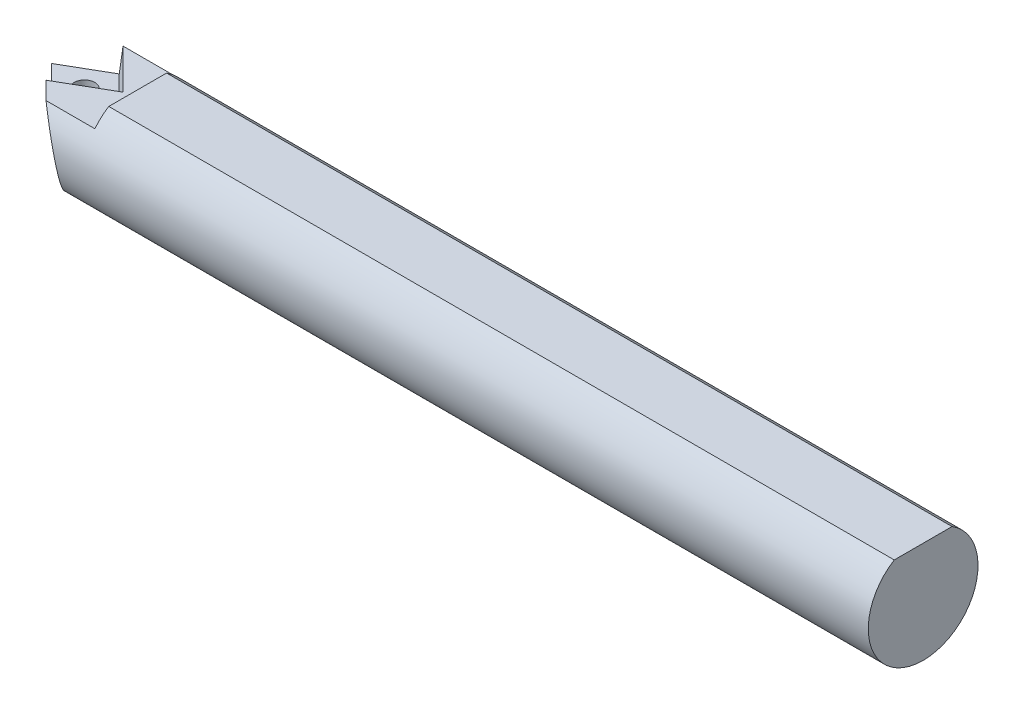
ISO-10303-21;
HEADER;
FILE_DESCRIPTION(('STEP AP214'),'2;1');
FILE_NAME('part.step','',(''),(''),'','','');
FILE_SCHEMA(('AUTOMOTIVE_DESIGN { 1 0 10303 214 1 1 1 1 }'));
ENDSEC;
DATA;
#1=APPLICATION_CONTEXT('core data for automotive mechanical design processes');
#2=APPLICATION_PROTOCOL_DEFINITION('international standard','automotive_design',2000,#1);
#3=PRODUCT_CONTEXT('',#1,'mechanical');
#4=PRODUCT('Part','Part','',(#3));
#5=PRODUCT_RELATED_PRODUCT_CATEGORY('part','',(#4));
#6=PRODUCT_DEFINITION_FORMATION('','',#4);
#7=PRODUCT_DEFINITION_CONTEXT('part definition',#1,'design');
#8=PRODUCT_DEFINITION('design','',#6,#7);
#9=PRODUCT_DEFINITION_SHAPE('','',#8);
#10=(LENGTH_UNIT() NAMED_UNIT(*) SI_UNIT(.MILLI.,.METRE.));
#11=(NAMED_UNIT(*) PLANE_ANGLE_UNIT() SI_UNIT($,.RADIAN.));
#12=(NAMED_UNIT(*) SI_UNIT($,.STERADIAN.) SOLID_ANGLE_UNIT());
#13=UNCERTAINTY_MEASURE_WITH_UNIT(LENGTH_MEASURE(1.E-05),#10,'distance_accuracy_value','');
#14=(GEOMETRIC_REPRESENTATION_CONTEXT(3) GLOBAL_UNCERTAINTY_ASSIGNED_CONTEXT((#13)) GLOBAL_UNIT_ASSIGNED_CONTEXT((#10,
#11,#12)) REPRESENTATION_CONTEXT('',''));
#15=CARTESIAN_POINT('',(0.,0.,0.));
#16=DIRECTION('',(0.,0.,1.));
#17=DIRECTION('',(1.,0.,0.));
#18=AXIS2_PLACEMENT_3D('',#15,#16,#17);
#19=CARTESIAN_POINT('',(-49.5,5.,-9.59205251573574));
#20=DIRECTION('',(0.,-1.,0.));
#21=DIRECTION('',(0.,0.,-1.));
#22=AXIS2_PLACEMENT_3D('',#19,#20,#21);
#23=PLANE('',#22);
#24=DIRECTION('',(0.707106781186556,0.,0.707106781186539));
#25=VECTOR('',#24,1.);
#26=CARTESIAN_POINT('',(-31.4325242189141,5.,31.4325242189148));
#27=LINE('',#26,#25);
#28=CARTESIAN_POINT('',(-59.1875165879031,5.,3.6775318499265));
#29=VERTEX_POINT('',#28);
#30=CARTESIAN_POINT('',(-56.6200504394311,5.,6.2449979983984));
#31=VERTEX_POINT('',#30);
#32=EDGE_CURVE('E110',#29,#31,#27,.T.);
#33=ORIENTED_EDGE('',*,*,#32,.T.);
#34=DIRECTION('',(-1.,0.,0.));
#35=VECTOR('',#34,1.);
#36=CARTESIAN_POINT('',(65.,5.,6.2449979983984));
#37=LINE('',#36,#35);
#38=CARTESIAN_POINT('',(-49.5,5.,6.2449979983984));
#39=VERTEX_POINT('',#38);
#40=EDGE_CURVE('E169',#39,#31,#37,.T.);
#41=ORIENTED_EDGE('',*,*,#40,.F.);
#42=DIRECTION('',(0.,0.,1.));
#43=VECTOR('',#42,1.);
#44=CARTESIAN_POINT('',(-49.5,5.,-9.59205251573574));
#45=LINE('',#44,#43);
#46=CARTESIAN_POINT('',(-49.5,5.,-6.2449979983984));
#47=VERTEX_POINT('',#46);
#48=EDGE_CURVE('E151',#47,#39,#45,.T.);
#49=ORIENTED_EDGE('',*,*,#48,.F.);
#50=DIRECTION('',(-1.,0.,0.));
#51=VECTOR('',#50,1.);
#52=CARTESIAN_POINT('',(65.,5.,-6.2449979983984));
#53=LINE('',#52,#51);
#54=CARTESIAN_POINT('',(-57.8811907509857,5.,-6.2449979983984));
#55=VERTEX_POINT('',#54);
#56=EDGE_CURVE('E166',#55,#47,#53,.F.);
#57=ORIENTED_EDGE('',*,*,#56,.F.);
#58=DIRECTION('',(-0.707106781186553,0.,-0.707106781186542));
#59=VECTOR('',#58,1.);
#60=CARTESIAN_POINT('',(-57.8811907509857,5.,-6.2449979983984));
#61=LINE('',#60,#59);
#62=CARTESIAN_POINT('',(-52.0687073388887,5.,-0.432514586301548));
#63=VERTEX_POINT('',#62);
#64=EDGE_CURVE('E133',#63,#55,#61,.T.);
#65=ORIENTED_EDGE('',*,*,#64,.F.);
#66=DIRECTION('',(0.866025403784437,0.,-0.500000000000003));
#67=VECTOR('',#66,1.);
#68=CARTESIAN_POINT('',(-52.0687073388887,5.,-0.432514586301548));
#69=LINE('',#68,#67);
#70=EDGE_CURVE('E126',#29,#63,#69,.T.);
#71=ORIENTED_EDGE('',*,*,#70,.F.);
#72=EDGE_LOOP('',(#33,#41,#49,#57,#65,#71));
#73=FACE_BOUND('',#72,.T.);
#74=ADVANCED_FACE('F42',(#73),#23,.F.);
#75=CARTESIAN_POINT('',(65.,0.,0.));
#76=DIRECTION('',(-1.,0.,0.));
#77=DIRECTION('',(0.,0.,1.));
#78=AXIS2_PLACEMENT_3D('',#75,#76,#77);
#79=CYLINDRICAL_SURFACE('',#78,8.);
#80=CARTESIAN_POINT('',(-59.310259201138,-8.,0.));
#81=CARTESIAN_POINT('',(-59.2381338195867,-8.00000067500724,0.043589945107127));
#82=CARTESIAN_POINT('',(-59.1622896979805,-7.99964806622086,0.0811104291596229));
#83=CARTESIAN_POINT('',(-59.0053343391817,-7.99878361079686,0.142907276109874));
#84=CARTESIAN_POINT('',(-58.9242186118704,-7.99827162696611,0.16717217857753));
#85=CARTESIAN_POINT('',(-58.7590856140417,-7.99747498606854,0.201731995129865));
#86=CARTESIAN_POINT('',(-58.6750693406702,-7.99719025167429,0.212031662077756));
#87=CARTESIAN_POINT('',(-58.5065163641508,-7.99701956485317,0.218377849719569));
#88=CARTESIAN_POINT('',(-58.421979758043,-7.9971335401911,0.21442695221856));
#89=CARTESIAN_POINT('',(-58.254782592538,-7.99769366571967,0.192393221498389));
#90=CARTESIAN_POINT('',(-58.1721217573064,-7.99813976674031,0.174312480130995));
#91=CARTESIAN_POINT('',(-58.0110038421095,-7.99906908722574,0.124533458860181));
#92=CARTESIAN_POINT('',(-57.9325469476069,-7.99955230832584,0.0928345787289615));
#93=CARTESIAN_POINT('',(-57.7820400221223,-8.00007272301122,0.016704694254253));
#94=CARTESIAN_POINT('',(-57.709992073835,-8.00010977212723,-0.0277304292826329));
#95=CARTESIAN_POINT('',(-57.5743835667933,-7.99913171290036,-0.12806401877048));
#96=CARTESIAN_POINT('',(-57.5108228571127,-7.99811662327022,-0.183962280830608));
#97=CARTESIAN_POINT('',(-57.3941553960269,-7.99439625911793,-0.30545755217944));
#98=CARTESIAN_POINT('',(-57.3410229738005,-7.99169520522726,-0.371030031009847));
#99=CARTESIAN_POINT('',(-57.2465344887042,-7.98402689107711,-0.51005084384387));
#100=CARTESIAN_POINT('',(-57.2051775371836,-7.9790598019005,-0.583498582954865));
#101=CARTESIAN_POINT('',(-57.1356409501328,-7.96647850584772,-0.735519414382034));
#102=CARTESIAN_POINT('',(-57.1073669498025,-7.95888396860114,-0.814050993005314));
#103=CARTESIAN_POINT('',(-57.0642497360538,-7.94084702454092,-0.974399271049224));
#104=CARTESIAN_POINT('',(-57.0494062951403,-7.93040466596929,-1.05621591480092));
#105=CARTESIAN_POINT('',(-57.0333883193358,-7.90673255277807,-1.22086219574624));
#106=CARTESIAN_POINT('',(-57.0322287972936,-7.89349975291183,-1.30369284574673));
#107=CARTESIAN_POINT('',(-57.0434379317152,-7.86460062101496,-1.46799844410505));
#108=CARTESIAN_POINT('',(-57.0558081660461,-7.84893400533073,-1.54947323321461));
#109=CARTESIAN_POINT('',(-57.0939767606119,-7.81538941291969,-1.71073768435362));
#110=CARTESIAN_POINT('',(-57.1200688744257,-7.79746985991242,-1.79044906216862));
#111=CARTESIAN_POINT('',(-57.1850148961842,-7.76055624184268,-1.94422948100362));
#112=CARTESIAN_POINT('',(-57.2238714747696,-7.74156195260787,-2.01829733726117));
#113=CARTESIAN_POINT('',(-57.3146683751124,-7.7029454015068,-2.16108031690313));
#114=CARTESIAN_POINT('',(-57.3669670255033,-7.68332143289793,-2.22956747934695));
#115=CARTESIAN_POINT('',(-57.4827072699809,-7.64525948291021,-2.35678260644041));
#116=CARTESIAN_POINT('',(-57.5461499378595,-7.62682161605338,-2.41550962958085));
#117=CARTESIAN_POINT('',(-57.6826763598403,-7.59243344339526,-2.52152140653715));
#118=CARTESIAN_POINT('',(-57.7557685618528,-7.57648534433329,-2.56879603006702));
#119=CARTESIAN_POINT('',(-57.909605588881,-7.54839453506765,-2.65020853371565));
#120=CARTESIAN_POINT('',(-57.9903477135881,-7.53625048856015,-2.68435102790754));
#121=CARTESIAN_POINT('',(-58.1532518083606,-7.51731526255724,-2.73691813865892));
#122=CARTESIAN_POINT('',(-58.2351780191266,-7.51030374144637,-2.75599295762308));
#123=CARTESIAN_POINT('',(-58.4013289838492,-7.50138574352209,-2.78017709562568));
#124=CARTESIAN_POINT('',(-58.4855528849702,-7.49947739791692,-2.78529152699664));
#125=CARTESIAN_POINT('',(-58.649363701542,-7.50090341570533,-2.78144683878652));
#126=CARTESIAN_POINT('',(-58.72897033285,-7.50397833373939,-2.77318419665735));
#127=CARTESIAN_POINT('',(-58.8855654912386,-7.51462244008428,-2.74420928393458));
#128=CARTESIAN_POINT('',(-58.9625540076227,-7.52219164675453,-2.72349696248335));
#129=CARTESIAN_POINT('',(-59.1119551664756,-7.54122564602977,-2.67033835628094));
#130=CARTESIAN_POINT('',(-59.1843613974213,-7.55269575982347,-2.63787603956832));
#131=CARTESIAN_POINT('',(-59.3227565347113,-7.57868016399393,-2.562264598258));
#132=CARTESIAN_POINT('',(-59.3887440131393,-7.593195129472,-2.51911310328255));
#133=CARTESIAN_POINT('',(-59.5159639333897,-7.62508299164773,-2.42092906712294));
#134=CARTESIAN_POINT('',(-59.5767951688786,-7.64256230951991,-2.36541136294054));
#135=CARTESIAN_POINT('',(-59.688441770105,-7.678678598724,-2.24539952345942));
#136=CARTESIAN_POINT('',(-59.7392543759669,-7.69731588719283,-2.18090292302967));
#137=CARTESIAN_POINT('',(-59.8318347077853,-7.73554351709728,-2.04128381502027));
#138=CARTESIAN_POINT('',(-59.8730630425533,-7.75513736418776,-1.96580369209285));
#139=CARTESIAN_POINT('',(-59.9421130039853,-7.79327784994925,-1.8086875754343));
#140=CARTESIAN_POINT('',(-59.9699339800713,-7.81182443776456,-1.72705128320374));
#141=CARTESIAN_POINT('',(-60.01132685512,-7.84700102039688,-1.55946440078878));
#142=CARTESIAN_POINT('',(-60.0248404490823,-7.86362292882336,-1.47349764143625));
#143=CARTESIAN_POINT('',(-60.0367803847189,-7.89415114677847,-1.30004813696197));
#144=CARTESIAN_POINT('',(-60.0352099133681,-7.90805802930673,-1.21256571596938));
#145=CARTESIAN_POINT('',(-60.0170633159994,-7.93239856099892,-1.04130677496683));
#146=CARTESIAN_POINT('',(-60.0009252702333,-7.9429215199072,-0.957496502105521));
#147=CARTESIAN_POINT('',(-59.9545468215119,-7.96097547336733,-0.793520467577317));
#148=CARTESIAN_POINT('',(-59.9243059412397,-7.96850636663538,-0.71335482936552));
#149=CARTESIAN_POINT('',(-59.8513929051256,-7.98066556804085,-0.560975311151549));
#150=CARTESIAN_POINT('',(-59.8090267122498,-7.98535739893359,-0.488619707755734));
#151=CARTESIAN_POINT('',(-59.7128026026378,-7.99254774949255,-0.351943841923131));
#152=CARTESIAN_POINT('',(-59.6589543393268,-7.99504810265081,-0.287616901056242));
#153=CARTESIAN_POINT('',(-59.5567687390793,-7.99799451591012,-0.184426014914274));
#154=CARTESIAN_POINT('',(-59.5106893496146,-7.99880734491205,-0.143308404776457));
#155=CARTESIAN_POINT('',(-59.4138234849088,-7.99980984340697,-0.0670438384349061));
#156=CARTESIAN_POINT('',(-59.3630369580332,-7.99999950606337,-0.0318969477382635));
#157=CARTESIAN_POINT('',(-59.310259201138,-8.,0.));
#158=B_SPLINE_CURVE_WITH_KNOTS('',3,(#80,#81,#82,#83,#84,#85,#86,#87,#88,#89,#90,#91,#92,#93,
#94,#95,#96,#97,#98,#99,#100,#101,#102,#103,#104,#105,#106,#107,#108,#109,#110,#111,#112,#113,
#114,#115,#116,#117,#118,#119,#120,#121,#122,#123,#124,#125,#126,#127,#128,#129,#130,#131,#132,
#133,#134,#135,#136,#137,#138,#139,#140,#141,#142,#143,#144,#145,#146,#147,#148,#149,#150,#151,
#152,#153,#154,#155,#156,#157),.UNSPECIFIED.,.T.,.F.,(4,2,2,2,2,2,2,2,2,2,2,2,2,2,2,2,2,2,2,2,2,
2,2,2,2,2,2,2,2,2,2,2,2,2,2,2,2,2,4),(0.,0.25259969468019,0.505417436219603,0.758149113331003,
1.01083500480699,1.26348349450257,1.51614312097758,1.76888455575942,2.02162149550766,
2.2737282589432,2.52581599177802,2.77605597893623,3.02629172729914,3.27680198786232,
3.5273414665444,3.78347688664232,4.03966593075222,4.30355940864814,4.56747832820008,
4.83162985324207,5.09568848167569,5.3476124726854,5.59944419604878,5.83858059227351,
6.07771796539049,6.31718286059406,6.55670090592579,6.80816288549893,7.05969403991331,
7.3230842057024,7.58648715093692,7.85095942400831,8.11537582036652,8.37209619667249,
8.62882526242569,8.87957445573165,9.1301136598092,9.31495148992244,9.49979134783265),.UNSPECIFIED.);
#159=CARTESIAN_POINT('',(-57.7584481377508,-8.,0.));
#160=VERTEX_POINT('',#159);
#161=CARTESIAN_POINT('',(-59.310259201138,-8.,0.));
#162=VERTEX_POINT('',#161);
#163=EDGE_CURVE('E190',#160,#162,#158,.T.);
#164=ORIENTED_EDGE('',*,*,#163,.T.);
#165=CARTESIAN_POINT('',(-59.310259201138,-8.,0.));
#166=CARTESIAN_POINT('',(-59.2954227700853,-7.99999999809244,0.008967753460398));
#167=CARTESIAN_POINT('',(-59.2804413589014,-7.99998491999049,0.0176965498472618));
#168=CARTESIAN_POINT('',(-59.2503196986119,-7.99992965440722,0.034587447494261));
#169=CARTESIAN_POINT('',(-59.2351816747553,-7.99988966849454,0.0427535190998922));
#170=CARTESIAN_POINT('',(-59.2047467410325,-7.99978982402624,0.058519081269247));
#171=CARTESIAN_POINT('',(-59.1894516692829,-7.99973010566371,0.0661221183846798));
#172=CARTESIAN_POINT('',(-59.1587031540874,-7.99959566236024,0.0807620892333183));
#173=CARTESIAN_POINT('',(-59.1432511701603,-7.99952102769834,0.0878020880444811));
#174=CARTESIAN_POINT('',(-59.1121891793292,-7.99936125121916,0.101316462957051));
#175=CARTESIAN_POINT('',(-59.0965802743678,-7.99927616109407,0.107793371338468));
#176=CARTESIAN_POINT('',(-59.0652048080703,-7.99909960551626,0.120182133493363));
#177=CARTESIAN_POINT('',(-59.0494390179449,-7.99900816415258,0.126095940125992));
#178=CARTESIAN_POINT('',(-59.0177501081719,-7.99882267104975,0.137359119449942));
#179=CARTESIAN_POINT('',(-59.0018274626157,-7.99872862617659,0.142709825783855));
#180=CARTESIAN_POINT('',(-58.9698251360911,-7.99854132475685,0.152847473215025));
#181=CARTESIAN_POINT('',(-58.9537456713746,-7.99844806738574,0.157635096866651));
#182=CARTESIAN_POINT('',(-58.9214299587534,-7.99826537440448,0.166647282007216));
#183=CARTESIAN_POINT('',(-58.9051937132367,-7.99817593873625,0.170871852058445));
#184=CARTESIAN_POINT('',(-58.8725646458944,-7.99800355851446,0.178758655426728));
#185=CARTESIAN_POINT('',(-58.8561716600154,-7.99792062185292,0.182420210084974));
#186=CARTESIAN_POINT('',(-58.8232292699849,-7.99776354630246,0.189181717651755));
#187=CARTESIAN_POINT('',(-58.806679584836,-7.99768942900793,0.192280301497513));
#188=CARTESIAN_POINT('',(-58.7734239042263,-7.99755193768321,0.197916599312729));
#189=CARTESIAN_POINT('',(-58.7567175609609,-7.9974886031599,0.200452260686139));
#190=CARTESIAN_POINT('',(-58.7231486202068,-7.99737426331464,0.204963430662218));
#191=CARTESIAN_POINT('',(-58.7062856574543,-7.99732331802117,0.206936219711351));
#192=CARTESIAN_POINT('',(-58.6724034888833,-7.99723498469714,0.210322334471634));
#193=CARTESIAN_POINT('',(-58.6553839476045,-7.99719767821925,0.211732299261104));
#194=CARTESIAN_POINT('',(-58.6211885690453,-7.99713749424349,0.213993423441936));
#195=CARTESIAN_POINT('',(-58.60401246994,-7.9971147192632,0.214840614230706));
#196=CARTESIAN_POINT('',(-58.569503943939,-7.99708411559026,0.215976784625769));
#197=CARTESIAN_POINT('',(-58.552171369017,-7.99707640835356,0.21626122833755));
#198=CARTESIAN_POINT('',(-58.5174845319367,-7.99707610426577,0.216272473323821));
#199=CARTESIAN_POINT('',(-58.5001302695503,-7.99708352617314,0.215998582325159));
#200=CARTESIAN_POINT('',(-58.4655785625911,-7.99711360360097,0.214882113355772));
#201=CARTESIAN_POINT('',(-58.4483809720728,-7.99713613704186,0.214044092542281));
#202=CARTESIAN_POINT('',(-58.4141428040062,-7.99719588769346,0.211799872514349));
#203=CARTESIAN_POINT('',(-58.3971019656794,-7.99723300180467,0.210397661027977));
#204=CARTESIAN_POINT('',(-58.3631773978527,-7.99732100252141,0.207025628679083));
#205=CARTESIAN_POINT('',(-58.346293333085,-7.99737180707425,0.205059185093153));
#206=CARTESIAN_POINT('',(-58.3126823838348,-7.9974859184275,0.200559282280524));
#207=CARTESIAN_POINT('',(-58.2959551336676,-7.99754916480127,0.198028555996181));
#208=CARTESIAN_POINT('',(-58.2626578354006,-7.99768653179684,0.192400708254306));
#209=CARTESIAN_POINT('',(-58.2460874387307,-7.99776061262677,0.18930564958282));
#210=CARTESIAN_POINT('',(-58.2131038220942,-7.99791766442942,0.182549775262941));
#211=CARTESIAN_POINT('',(-58.1966903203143,-7.99800061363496,0.178890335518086));
#212=CARTESIAN_POINT('',(-58.1640204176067,-7.9981730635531,0.171006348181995));
#213=CARTESIAN_POINT('',(-58.147763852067,-7.99826255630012,0.166782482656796));
#214=CARTESIAN_POINT('',(-58.1154076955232,-7.998445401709,0.157770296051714));
#215=CARTESIAN_POINT('',(-58.0993081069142,-7.99853875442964,0.152981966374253));
#216=CARTESIAN_POINT('',(-58.0672657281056,-7.99872627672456,0.142841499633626));
#217=CARTESIAN_POINT('',(-58.051323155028,-7.99882044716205,0.137488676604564));
#218=CARTESIAN_POINT('',(-58.0195945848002,-7.99900621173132,0.126219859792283));
#219=CARTESIAN_POINT('',(-58.0038090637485,-7.99909779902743,0.120302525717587));
#220=CARTESIAN_POINT('',(-57.9723943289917,-7.99927465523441,0.107905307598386));
#221=CARTESIAN_POINT('',(-57.9567658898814,-7.99935990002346,0.10142346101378));
#222=CARTESIAN_POINT('',(-57.9256650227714,-7.99951998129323,0.0878978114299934));
#223=CARTESIAN_POINT('',(-57.910193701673,-7.99959476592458,0.0808514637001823));
#224=CARTESIAN_POINT('',(-57.8794067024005,-7.99972948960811,0.0661973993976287));
#225=CARTESIAN_POINT('',(-57.8640924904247,-7.99978933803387,0.0585866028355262));
#226=CARTESIAN_POINT('',(-57.8336194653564,-7.99988940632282,0.0428041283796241));
#227=CARTESIAN_POINT('',(-57.8184624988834,-7.99992948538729,0.0346288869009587));
#228=CARTESIAN_POINT('',(-57.7883031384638,-7.99998488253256,0.0177182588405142));
#229=CARTESIAN_POINT('',(-57.7733029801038,-7.99999999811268,0.00897888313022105));
#230=CARTESIAN_POINT('',(-57.7584481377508,-8.,0.));
#231=B_SPLINE_CURVE_WITH_KNOTS('',3,(#165,#166,#167,#168,#169,#170,#171,#172,#173,#174,#175,
#176,#177,#178,#179,#180,#181,#182,#183,#184,#185,#186,#187,#188,#189,#190,#191,#192,#193,#194,
#195,#196,#197,#198,#199,#200,#201,#202,#203,#204,#205,#206,#207,#208,#209,#210,#211,#212,#213,
#214,#215,#216,#217,#218,#219,#220,#221,#222,#223,#224,#225,#226,#227,#228,#229,#230),
.UNSPECIFIED.,.F.,.F.,(4,2,2,2,2,2,2,2,2,2,2,2,2,2,2,2,2,2,2,2,2,2,2,2,2,2,2,2,2,2,2,2,4),(0.,
0.0520067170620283,0.103597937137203,0.154830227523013,0.205761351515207,0.25645010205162,
0.306956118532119,0.3573396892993,0.407661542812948,0.457982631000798,0.508363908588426,
0.55886611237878,0.609549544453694,0.660473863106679,0.71169788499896,0.763279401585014,
0.815275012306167,0.867335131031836,0.918979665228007,0.970265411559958,1.021250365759,
1.07199355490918,1.1225548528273,1.17299478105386,1.22337429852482,1.27375458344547,
1.32419681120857,1.37476193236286,1.42551045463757,1.47650223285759,1.52779627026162,
1.5794505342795,1.63152178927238),.UNSPECIFIED.);
#232=EDGE_CURVE('E66',#162,#160,#231,.T.);
#233=ORIENTED_EDGE('',*,*,#232,.T.);
#234=EDGE_LOOP('',(#164,#233));
#235=FACE_BOUND('',#234,.T.);
#236=CARTESIAN_POINT('',(-66.9345747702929,0.,0.));
#237=DIRECTION('',(0.492403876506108,0.173648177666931,0.852868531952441));
#238=DIRECTION('',(-0.870366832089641,0.0982402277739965,0.48250433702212));
#239=AXIS2_PLACEMENT_3D('',#236,#237,#238);
#240=ELLIPSE('',#239,16.2468257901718,8.);
#241=CARTESIAN_POINT('',(-61.3161730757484,-7.82800168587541,-1.64996654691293));
#242=VERTEX_POINT('',#241);
#243=EDGE_CURVE('E141',#55,#242,#240,.F.);
#244=ORIENTED_EDGE('',*,*,#243,.F.);
#245=ORIENTED_EDGE('',*,*,#56,.T.);
#246=CARTESIAN_POINT('',(-49.5,0.,0.));
#247=DIRECTION('',(1.,0.,0.));
#248=DIRECTION('',(0.,0.,-1.));
#249=AXIS2_PLACEMENT_3D('',#246,#247,#248);
#250=CIRCLE('',#249,8.);
#251=CARTESIAN_POINT('',(-49.5,6.8,-4.2142615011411));
#252=VERTEX_POINT('',#251);
#253=EDGE_CURVE('E165',#47,#252,#250,.T.);
#254=ORIENTED_EDGE('',*,*,#253,.T.);
#255=DIRECTION('',(-1.,0.,0.));
#256=VECTOR('',#255,1.);
#257=CARTESIAN_POINT('',(65.,6.8,-4.2142615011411));
#258=LINE('',#257,#256);
#259=CARTESIAN_POINT('',(65.,6.8,-4.2142615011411));
#260=VERTEX_POINT('',#259);
#261=EDGE_CURVE('E175',#260,#252,#258,.T.);
#262=ORIENTED_EDGE('',*,*,#261,.F.);
#263=CARTESIAN_POINT('',(65.,0.,0.));
#264=DIRECTION('',(1.,0.,0.));
#265=DIRECTION('',(0.,0.,-1.));
#266=AXIS2_PLACEMENT_3D('',#263,#264,#265);
#267=CIRCLE('',#266,8.);
#268=CARTESIAN_POINT('',(65.,6.8,4.2142615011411));
#269=VERTEX_POINT('',#268);
#270=EDGE_CURVE('E183',#269,#260,#267,.T.);
#271=ORIENTED_EDGE('',*,*,#270,.F.);
#272=DIRECTION('',(-1.,0.,0.));
#273=VECTOR('',#272,1.);
#274=CARTESIAN_POINT('',(65.,6.8,4.2142615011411));
#275=LINE('',#274,#273);
#276=CARTESIAN_POINT('',(-49.5,6.8,4.2142615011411));
#277=VERTEX_POINT('',#276);
#278=EDGE_CURVE('E172',#277,#269,#275,.F.);
#279=ORIENTED_EDGE('',*,*,#278,.F.);
#280=EDGE_CURVE('E161',#277,#39,#250,.T.);
#281=ORIENTED_EDGE('',*,*,#280,.T.);
#282=ORIENTED_EDGE('',*,*,#40,.T.);
#283=CARTESIAN_POINT('',(-61.6182284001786,0.,0.));
#284=DIRECTION('',(0.696364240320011,0.173648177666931,-0.696364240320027));
#285=DIRECTION('',(-0.717688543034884,0.168488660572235,-0.675673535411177));
#286=AXIS2_PLACEMENT_3D('',#283,#284,#285);
#287=ELLIPSE('',#286,11.4882406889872,8.);
#288=EDGE_CURVE('E114',#242,#31,#287,.F.);
#289=ORIENTED_EDGE('',*,*,#288,.F.);
#290=EDGE_LOOP('',(#244,#245,#254,#262,#271,#279,#281,#282,#289));
#291=FACE_BOUND('',#290,.T.);
#292=ADVANCED_FACE('F44',(#235,#291),#79,.T.);
#293=CARTESIAN_POINT('',(-57.8811907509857,5.,-6.2449979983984));
#294=DIRECTION('',(0.701836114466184,-0.121869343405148,-0.701836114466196));
#295=DIRECTION('',(-0.707106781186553,0.,-0.707106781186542));
#296=AXIS2_PLACEMENT_3D('',#293,#294,#295);
#297=PLANE('',#296);
#298=DIRECTION('',(0.0186485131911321,-0.981775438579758,0.18912752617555));
#299=VECTOR('',#298,1.);
#300=CARTESIAN_POINT('',(-57.8811907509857,5.,-6.2449979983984));
#301=LINE('',#300,#299);
#302=CARTESIAN_POINT('',(-57.8207876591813,1.82,-5.6324082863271));
#303=VERTEX_POINT('',#302);
#304=EDGE_CURVE('E243',#303,#55,#301,.F.);
#305=ORIENTED_EDGE('',*,*,#304,.F.);
#306=DIRECTION('',(-0.707106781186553,0.,-0.707106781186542));
#307=VECTOR('',#306,1.);
#308=CARTESIAN_POINT('',(-58.1572840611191,1.82,-5.96890468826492));
#309=LINE('',#308,#307);
#310=CARTESIAN_POINT('',(-52.7046124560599,1.82,-0.516233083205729));
#311=VERTEX_POINT('',#310);
#312=EDGE_CURVE('E152',#311,#303,#309,.T.);
#313=ORIENTED_EDGE('',*,*,#312,.F.);
#314=DIRECTION('',(0.19602269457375,0.980259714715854,0.0258068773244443));
#315=VECTOR('',#314,1.);
#316=CARTESIAN_POINT('',(-52.0687073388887,5.,-0.432514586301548));
#317=LINE('',#316,#315);
#318=EDGE_CURVE('E148',#311,#63,#317,.T.);
#319=ORIENTED_EDGE('',*,*,#318,.T.);
#320=ORIENTED_EDGE('',*,*,#64,.T.);
#321=EDGE_LOOP('',(#305,#313,#319,#320));
#322=FACE_BOUND('',#321,.T.);
#323=ADVANCED_FACE('F215',(#322),#297,.F.);
#324=CARTESIAN_POINT('',(-52.0687073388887,5.,-0.432514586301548));
#325=DIRECTION('',(0.496273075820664,-0.121869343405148,0.859570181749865));
#326=DIRECTION('',(0.866025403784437,0.,-0.500000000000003));
#327=AXIS2_PLACEMENT_3D('',#324,#325,#326);
#328=PLANE('',#327);
#329=DIRECTION('',(-0.0669628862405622,0.981775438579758,0.177856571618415));
#330=VECTOR('',#329,1.);
#331=CARTESIAN_POINT('',(-59.1066458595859,3.814314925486,3.46273539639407));
#332=LINE('',#331,#330);
#333=CARTESIAN_POINT('',(-58.9706217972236,1.82,3.10144909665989));
#334=VERTEX_POINT('',#333);
#335=EDGE_CURVE('E59',#29,#334,#332,.F.);
#336=ORIENTED_EDGE('',*,*,#335,.F.);
#337=ORIENTED_EDGE('',*,*,#70,.T.);
#338=ORIENTED_EDGE('',*,*,#318,.F.);
#339=DIRECTION('',(0.866025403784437,0.,-0.500000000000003));
#340=VECTOR('',#339,1.);
#341=CARTESIAN_POINT('',(-52.2639347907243,1.82,-0.770658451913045));
#342=LINE('',#341,#340);
#343=EDGE_CURVE('E128',#334,#311,#342,.T.);
#344=ORIENTED_EDGE('',*,*,#343,.F.);
#345=EDGE_LOOP('',(#336,#337,#338,#344));
#346=FACE_BOUND('',#345,.T.);
#347=ADVANCED_FACE('F124',(#346),#328,.F.);
#348=CARTESIAN_POINT('',(0.,1.82,0.));
#349=DIRECTION('',(0.,-1.,0.));
#350=DIRECTION('',(0.,0.,-1.));
#351=AXIS2_PLACEMENT_3D('',#348,#349,#350);
#352=PLANE('',#351);
#353=CARTESIAN_POINT('',(-58.5343536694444,1.82,-1.28373307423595));
#354=DIRECTION('',(0.,1.,0.));
#355=DIRECTION('',(0.,0.,1.));
#356=AXIS2_PLACEMENT_3D('',#353,#354,#355);
#357=CIRCLE('',#356,1.5);
#358=CARTESIAN_POINT('',(-58.5343536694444,1.82,0.216266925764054));
#359=VERTEX_POINT('',#358);
#360=EDGE_CURVE('E135',#359,#359,#357,.T.);
#361=ORIENTED_EDGE('',*,*,#360,.F.);
#362=EDGE_LOOP('',(#361));
#363=FACE_BOUND('',#362,.T.);
#364=DIRECTION('',(-0.866025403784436,0.,0.500000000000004));
#365=VECTOR('',#364,1.);
#366=CARTESIAN_POINT('',(-16.8941012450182,1.82,-29.2614417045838));
#367=LINE('',#366,#365);
#368=CARTESIAN_POINT('',(-64.0867970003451,1.82,-2.01472610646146));
#369=VERTEX_POINT('',#368);
#370=EDGE_CURVE('E12',#369,#303,#367,.F.);
#371=ORIENTED_EDGE('',*,*,#370,.F.);
#372=DIRECTION('',(0.707106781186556,0.,0.707106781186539));
#373=VECTOR('',#372,1.);
#374=CARTESIAN_POINT('',(-31.036035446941,1.82,31.0360354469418));
#375=LINE('',#374,#373);
#376=EDGE_CURVE('E52',#334,#369,#375,.F.);
#377=ORIENTED_EDGE('',*,*,#376,.F.);
#378=ORIENTED_EDGE('',*,*,#343,.T.);
#379=ORIENTED_EDGE('',*,*,#312,.T.);
#380=EDGE_LOOP('',(#371,#377,#378,#379));
#381=FACE_BOUND('',#380,.T.);
#382=ADVANCED_FACE('F207',(#363,#381),#352,.F.);
#383=CARTESIAN_POINT('',(65.,0.,0.));
#384=DIRECTION('',(1.,0.,0.));
#385=DIRECTION('',(0.,0.,-1.));
#386=AXIS2_PLACEMENT_3D('',#383,#384,#385);
#387=PLANE('',#386);
#388=ORIENTED_EDGE('',*,*,#270,.T.);
#389=DIRECTION('',(0.,0.,1.));
#390=VECTOR('',#389,1.);
#391=CARTESIAN_POINT('',(65.,6.8,0.));
#392=LINE('',#391,#390);
#393=EDGE_CURVE('E179',#260,#269,#392,.T.);
#394=ORIENTED_EDGE('',*,*,#393,.T.);
#395=EDGE_LOOP('',(#388,#394));
#396=FACE_BOUND('',#395,.T.);
#397=ADVANCED_FACE('F211',(#396),#387,.T.);
#398=CARTESIAN_POINT('',(0.,6.8,0.));
#399=DIRECTION('',(0.,1.,0.));
#400=DIRECTION('',(0.,0.,1.));
#401=AXIS2_PLACEMENT_3D('',#398,#399,#400);
#402=PLANE('',#401);
#403=DIRECTION('',(0.,0.,-1.));
#404=VECTOR('',#403,1.);
#405=CARTESIAN_POINT('',(-49.5,6.8,0.));
#406=LINE('',#405,#404);
#407=EDGE_CURVE('E187',#277,#252,#406,.T.);
#408=ORIENTED_EDGE('',*,*,#407,.F.);
#409=ORIENTED_EDGE('',*,*,#278,.T.);
#410=ORIENTED_EDGE('',*,*,#393,.F.);
#411=ORIENTED_EDGE('',*,*,#261,.T.);
#412=EDGE_LOOP('',(#408,#409,#410,#411));
#413=FACE_BOUND('',#412,.T.);
#414=ADVANCED_FACE('F221',(#413),#402,.T.);
#415=CARTESIAN_POINT('',(-49.5,0.,0.));
#416=DIRECTION('',(1.,0.,0.));
#417=DIRECTION('',(0.,0.,-1.));
#418=AXIS2_PLACEMENT_3D('',#415,#416,#417);
#419=PLANE('',#418);
#420=ORIENTED_EDGE('',*,*,#48,.T.);
#421=ORIENTED_EDGE('',*,*,#280,.F.);
#422=ORIENTED_EDGE('',*,*,#407,.T.);
#423=ORIENTED_EDGE('',*,*,#253,.F.);
#424=EDGE_LOOP('',(#420,#421,#422,#423));
#425=FACE_BOUND('',#424,.T.);
#426=ADVANCED_FACE('F204',(#425),#419,.F.);
#427=CARTESIAN_POINT('',(-58.5343536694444,-8.,-1.28373307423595));
#428=DIRECTION('',(0.,1.,0.));
#429=DIRECTION('',(0.,0.,1.));
#430=AXIS2_PLACEMENT_3D('',#427,#428,#429);
#431=CYLINDRICAL_SURFACE('',#430,1.5);
#432=ORIENTED_EDGE('',*,*,#360,.T.);
#433=EDGE_LOOP('',(#432));
#434=FACE_BOUND('',#433,.T.);
#435=ORIENTED_EDGE('',*,*,#163,.F.);
#436=ORIENTED_EDGE('',*,*,#232,.F.);
#437=EDGE_LOOP('',(#435,#436));
#438=FACE_BOUND('',#437,.T.);
#439=ADVANCED_FACE('F198',(#434,#438),#431,.F.);
#440=CARTESIAN_POINT('',(-17.1744611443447,5.,-29.7470392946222));
#441=DIRECTION('',(0.492403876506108,0.173648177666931,0.852868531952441));
#442=DIRECTION('',(0.866025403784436,0.,-0.500000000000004));
#443=AXIS2_PLACEMENT_3D('',#440,#441,#442);
#444=PLANE('',#443);
#445=ORIENTED_EDGE('',*,*,#243,.T.);
#446=DIRECTION('',(-0.275833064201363,0.960519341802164,-0.0363141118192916));
#447=VECTOR('',#446,1.);
#448=CARTESIAN_POINT('',(-61.6378276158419,-6.7079205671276,-1.69231317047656));
#449=LINE('',#448,#447);
#450=EDGE_CURVE('E119',#242,#369,#449,.T.);
#451=ORIENTED_EDGE('',*,*,#450,.T.);
#452=ORIENTED_EDGE('',*,*,#370,.T.);
#453=ORIENTED_EDGE('',*,*,#304,.T.);
#454=EDGE_LOOP('',(#445,#451,#452,#453));
#455=FACE_BOUND('',#454,.T.);
#456=ADVANCED_FACE('F203',(#455),#444,.F.);
#457=CARTESIAN_POINT('',(-31.4325242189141,5.,31.4325242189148));
#458=DIRECTION('',(0.696364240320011,0.173648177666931,-0.696364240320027));
#459=DIRECTION('',(-0.707106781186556,0.,-0.707106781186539));
#460=AXIS2_PLACEMENT_3D('',#457,#458,#459);
#461=PLANE('',#460);
#462=ORIENTED_EDGE('',*,*,#288,.T.);
#463=ORIENTED_EDGE('',*,*,#32,.F.);
#464=ORIENTED_EDGE('',*,*,#335,.T.);
#465=ORIENTED_EDGE('',*,*,#376,.T.);
#466=ORIENTED_EDGE('',*,*,#450,.F.);
#467=EDGE_LOOP('',(#462,#463,#464,#465,#466));
#468=FACE_BOUND('',#467,.T.);
#469=ADVANCED_FACE('F111',(#468),#461,.F.);
#470=CLOSED_SHELL('',(#74,#292,#323,#347,#382,#397,#414,#426,#439,#456,#469));
#471=MANIFOLD_SOLID_BREP('B2',#470);
#472=ADVANCED_BREP_SHAPE_REPRESENTATION('',(#18,#471),#14);
#473=SHAPE_DEFINITION_REPRESENTATION(#9,#472);
ENDSEC;
END-ISO-10303-21;
